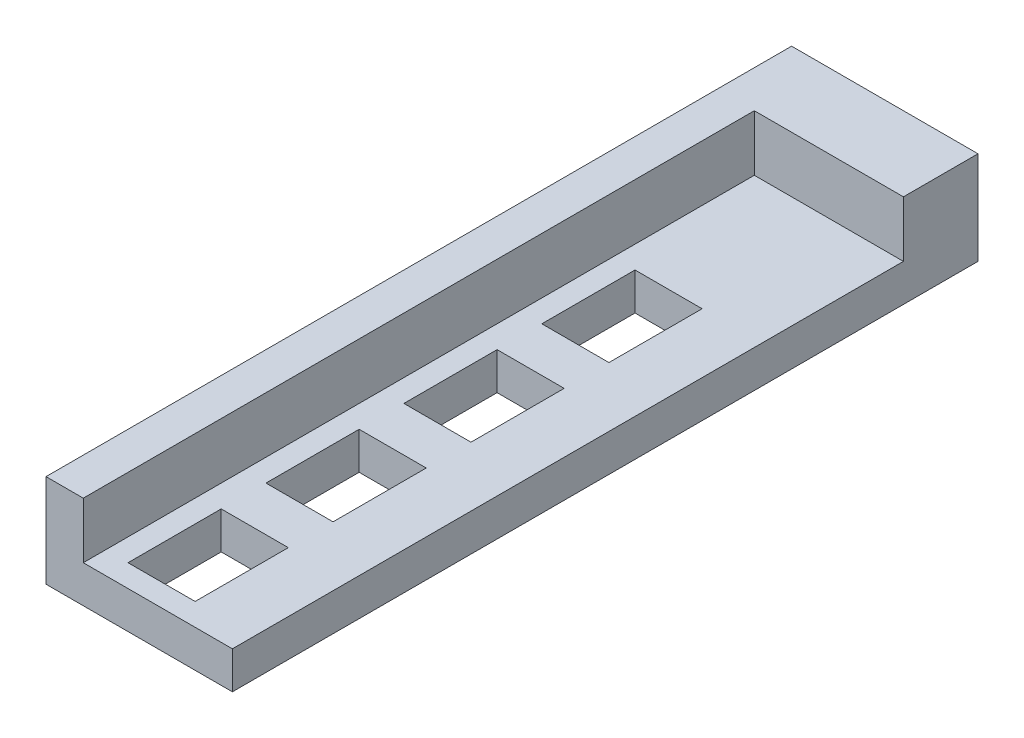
from build123d import *

# Parameters (mm, degrees)
SKETCH1_W                 = 50
SKETCH1_H                 = 25
BOSS_EXTRUDE1_DEPTH       = 200
SHELL1_T                  = -10
SHELL1_THICKNESS_2_FACE_W = 40
SHELL1_THICKNESS_2_FACE_H = 15
SHELL1_THICKNESS_2_DEPTH  = 10
SKETCH2_W                 = 18
SKETCH2_H                 = 25
CUT_EXTRUDE1_DEPTH        = 207.700266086
LPATTERN1_COUNT           = 4
LPATTERN1_PITCH           = 37


with BuildPart() as part:
    # Sketch1 → Boss-Extrude1 (new body)
    with BuildSketch(Plane.XY):
        with Locations((25, 12.5)):
            Rectangle(SKETCH1_W, SKETCH1_H)
    extrude(amount=BOSS_EXTRUDE1_DEPTH)

    # Shell1
    shell1_openings = [part.faces().sort_by_distance(p)[0] for p in [
        (25, 12.5, 200),
        (25, 25, 100),
        (50, 12.5, 100),
    ]]
    offset(amount=SHELL1_T, openings=shell1_openings, kind=Kind.INTERSECTION)

    # Shell1 thickness 2 face (on inner face of the shell) → Shell1 thickness 2 (add)
    with BuildSketch(Plane(origin=(30, 17.5, 10), x_dir=(-1, 0, 0), z_dir=(0, 0, -1))):
        Rectangle(SHELL1_THICKNESS_2_FACE_W, SHELL1_THICKNESS_2_FACE_H)
    extrude(amount=-SHELL1_THICKNESS_2_DEPTH)

    # Sketch2 → Cut-Extrude1 (cut, through all)
    with BuildSketch(Plane(origin=(0, 10, 0), x_dir=(1, 0, 0), z_dir=(0, 1, 0))):
        with Locations((25, -181.5)):
            Rectangle(SKETCH2_W, SKETCH2_H)
    cut_extrude1 = extrude(amount=-CUT_EXTRUDE1_DEPTH, mode=Mode.SUBTRACT)

    # LPattern1: Cut-Extrude1 ×4
    with Locations(*[(0, 0, -i * LPATTERN1_PITCH) for i in range(1, LPATTERN1_COUNT)]):
        add(cut_extrude1, mode=Mode.SUBTRACT)


solid = part.part
